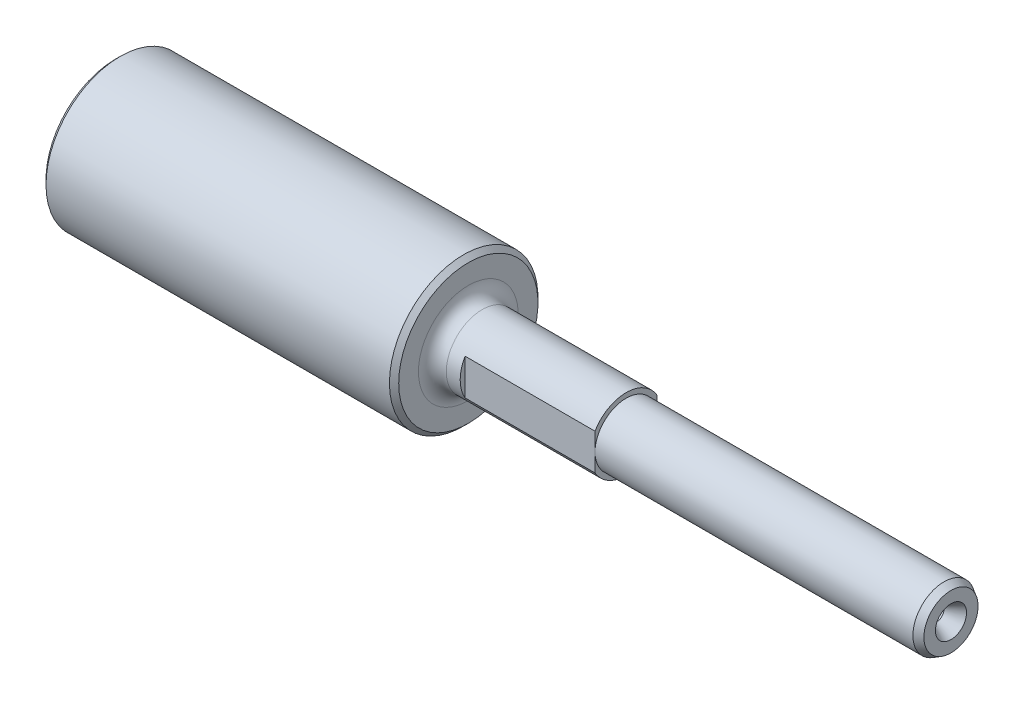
from build123d import *

# Parameters (mm, degrees)
CHANFREIN1_SIZE                                  = 1.5
CHANFREIN1_SIZE2                                 = 0.866025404
CONG_1_R                                         = 3
CHANFREIN2_SIZE                                  = 1
ENL_V_START                                      = -28
ENL_V_MAT_EXTRU_1_DEPTH                          = 28
FRAISAGE_POUR_VIS_T_TE_FRAIS_E_6_PAN_D           = 3.15
FRAISAGE_POUR_VIS_T_TE_FRAIS_E_6_PAN_DEPTH       = 7
FRAISAGE_POUR_VIS_T_TE_FRAIS_E_6_PAN_CSINK_D     = 6.7
FRAISAGE_POUR_VIS_T_TE_FRAIS_E_6_PAN_CSINK_ANGLE = 60
FRAISAGE_POUR_VIS_T_TE_FRAIS_E_6_PAN_TIP         = 0.946355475


with BuildPart() as part:
    # Esquisse1 → R_volution1 (revolve)
    with BuildSketch(Plane.XY, mode=Mode.PRIVATE) as r_volution1_sk:
        Polygon((0, 6.7), (0, 7.75), (-34, 7.75), (-34, 16), (-110, 16), (-110, 0), (70, 0), (70, 6.7), align=None)
    revolve(r_volution1_sk.sketch.rotate(Axis((0, 0, 0), (1, 0, 0)), 90), axis=Axis((0, 0, 0), (1, 0, 0)))

    # Chanfrein1
    chanfrein1_edges = [part.edges().sort_by_distance(p)[0] for p in [
        (70, 0, -6.7),
    ]]
    chanfrein1_side = [part.faces().sort_by_distance(p)[0] for p in [
        (35, 0, -6.7),
    ]]
    chamfer(chanfrein1_edges, length=CHANFREIN1_SIZE, length2=CHANFREIN1_SIZE2, reference=chanfrein1_side[0])

    # Cong_1
    cong_1_edges = [part.edges().sort_by_distance(p)[0] for p in [
        (-34, 0, -7.75),
    ]]
    fillet(cong_1_edges, radius=CONG_1_R)

    # Chanfrein2
    chanfrein2_edges = [part.edges().sort_by_distance(p)[0] for p in [
        (-34, 0, -16),
        (-110, 0, -16),
    ]]
    chamfer(chanfrein2_edges, length=CHANFREIN2_SIZE)

    # Esquisse2 → Enl_v. mat.-Extru.1 (cut)
    with BuildSketch(Plane(origin=(0, 0, 0), x_dir=(0, 0, -1), z_dir=(1, 0, 0)).offset(ENL_V_START)):
        with BuildLine():
            Line((-6.7, 3.895189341), (-6.7, -3.895189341))
            ThreePointArc((-6.7, -3.895189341), (-7.75, 0), (-6.7, 3.895189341))
        make_face()
        with BuildLine():
            Line((6.7, 3.895189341), (6.7, -3.895189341))
            ThreePointArc((6.7, -3.895189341), (7.75, 0), (6.7, 3.895189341))
        make_face()
    extrude(amount=ENL_V_MAT_EXTRU_1_DEPTH, mode=Mode.SUBTRACT)

    # Fraisage pour vis _ t_te frais_e _ 6 pan
    with Locations(Plane(origin=(70, 0, 0), x_dir=(0, 0, -1), z_dir=(1, 0, 0))):
        with Locations((0, 0)):
            CounterSinkHole(FRAISAGE_POUR_VIS_T_TE_FRAIS_E_6_PAN_D / 2, FRAISAGE_POUR_VIS_T_TE_FRAIS_E_6_PAN_CSINK_D / 2, depth=FRAISAGE_POUR_VIS_T_TE_FRAIS_E_6_PAN_DEPTH, counter_sink_angle=FRAISAGE_POUR_VIS_T_TE_FRAIS_E_6_PAN_CSINK_ANGLE)
            with Locations((0, 0, -(FRAISAGE_POUR_VIS_T_TE_FRAIS_E_6_PAN_DEPTH + FRAISAGE_POUR_VIS_T_TE_FRAIS_E_6_PAN_TIP / 2))):  # 118° drill point
                Cone(0, FRAISAGE_POUR_VIS_T_TE_FRAIS_E_6_PAN_D / 2, FRAISAGE_POUR_VIS_T_TE_FRAIS_E_6_PAN_TIP, mode=Mode.SUBTRACT)


solid = part.part
